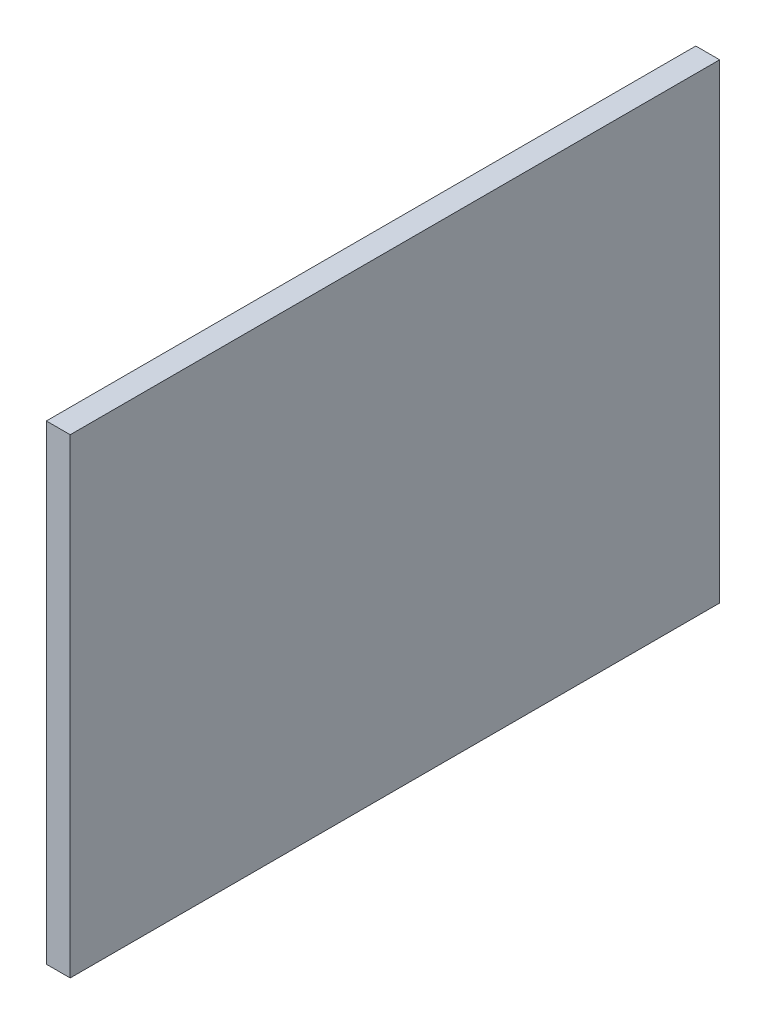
ISO-10303-21;
HEADER;
FILE_DESCRIPTION(('STEP AP214'),'2;1');
FILE_NAME('part.step','',(''),(''),'','','');
FILE_SCHEMA(('AUTOMOTIVE_DESIGN { 1 0 10303 214 1 1 1 1 }'));
ENDSEC;
DATA;
#1=APPLICATION_CONTEXT('core data for automotive mechanical design processes');
#2=APPLICATION_PROTOCOL_DEFINITION('international standard','automotive_design',2000,#1);
#3=PRODUCT_CONTEXT('',#1,'mechanical');
#4=PRODUCT('Part','Part','',(#3));
#5=PRODUCT_RELATED_PRODUCT_CATEGORY('part','',(#4));
#6=PRODUCT_DEFINITION_FORMATION('','',#4);
#7=PRODUCT_DEFINITION_CONTEXT('part definition',#1,'design');
#8=PRODUCT_DEFINITION('design','',#6,#7);
#9=PRODUCT_DEFINITION_SHAPE('','',#8);
#10=(LENGTH_UNIT() NAMED_UNIT(*) SI_UNIT(.MILLI.,.METRE.));
#11=(NAMED_UNIT(*) PLANE_ANGLE_UNIT() SI_UNIT($,.RADIAN.));
#12=(NAMED_UNIT(*) SI_UNIT($,.STERADIAN.) SOLID_ANGLE_UNIT());
#13=UNCERTAINTY_MEASURE_WITH_UNIT(LENGTH_MEASURE(1.E-05),#10,'distance_accuracy_value','');
#14=(GEOMETRIC_REPRESENTATION_CONTEXT(3) GLOBAL_UNCERTAINTY_ASSIGNED_CONTEXT((#13)) GLOBAL_UNIT_ASSIGNED_CONTEXT((#10,
#11,#12)) REPRESENTATION_CONTEXT('',''));
#15=CARTESIAN_POINT('',(0.,0.,0.));
#16=DIRECTION('',(0.,0.,1.));
#17=DIRECTION('',(1.,0.,0.));
#18=AXIS2_PLACEMENT_3D('',#15,#16,#17);
#19=CARTESIAN_POINT('',(263.000000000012,1002.65327241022,-490.));
#20=DIRECTION('',(-1.,0.,0.));
#21=DIRECTION('',(0.,-1.,0.));
#22=AXIS2_PLACEMENT_3D('',#19,#20,#21);
#23=PLANE('',#22);
#24=DIRECTION('',(0.,-1.,0.));
#25=VECTOR('',#24,1.);
#26=CARTESIAN_POINT('',(263.000000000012,1002.65327241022,0.));
#27=LINE('',#26,#25);
#28=CARTESIAN_POINT('',(263.000000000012,1002.65327241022,0.));
#29=VERTEX_POINT('',#28);
#30=CARTESIAN_POINT('',(263.000000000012,647.653272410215,0.));
#31=VERTEX_POINT('',#30);
#32=EDGE_CURVE('E97',#29,#31,#27,.T.);
#33=ORIENTED_EDGE('',*,*,#32,.F.);
#34=DIRECTION('',(0.,0.,1.));
#35=VECTOR('',#34,1.);
#36=CARTESIAN_POINT('',(263.000000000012,1002.65327241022,-490.));
#37=LINE('',#36,#35);
#38=CARTESIAN_POINT('',(263.000000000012,1002.65327241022,-490.));
#39=VERTEX_POINT('',#38);
#40=EDGE_CURVE('E11',#39,#29,#37,.T.);
#41=ORIENTED_EDGE('',*,*,#40,.F.);
#42=DIRECTION('',(0.,-1.,0.));
#43=VECTOR('',#42,1.);
#44=CARTESIAN_POINT('',(263.000000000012,1002.65327241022,-490.));
#45=LINE('',#44,#43);
#46=CARTESIAN_POINT('',(263.000000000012,647.653272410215,-490.));
#47=VERTEX_POINT('',#46);
#48=EDGE_CURVE('E91',#39,#47,#45,.T.);
#49=ORIENTED_EDGE('',*,*,#48,.T.);
#50=DIRECTION('',(0.,0.,1.));
#51=VECTOR('',#50,1.);
#52=CARTESIAN_POINT('',(263.000000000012,647.653272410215,-490.));
#53=LINE('',#52,#51);
#54=EDGE_CURVE('E36',#47,#31,#53,.T.);
#55=ORIENTED_EDGE('',*,*,#54,.T.);
#56=EDGE_LOOP('',(#33,#41,#49,#55));
#57=FACE_BOUND('',#56,.T.);
#58=ADVANCED_FACE('F33',(#57),#23,.T.);
#59=CARTESIAN_POINT('',(263.000000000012,1002.65327241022,-490.));
#60=DIRECTION('',(0.,1.,0.));
#61=DIRECTION('',(-1.,0.,0.));
#62=AXIS2_PLACEMENT_3D('',#59,#60,#61);
#63=PLANE('',#62);
#64=DIRECTION('',(-1.,0.,0.));
#65=VECTOR('',#64,1.);
#66=CARTESIAN_POINT('',(263.000000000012,1002.65327241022,0.));
#67=LINE('',#66,#65);
#68=CARTESIAN_POINT('',(281.000000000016,1002.65327241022,0.));
#69=VERTEX_POINT('',#68);
#70=EDGE_CURVE('E93',#69,#29,#67,.T.);
#71=ORIENTED_EDGE('',*,*,#70,.F.);
#72=DIRECTION('',(0.,0.,1.));
#73=VECTOR('',#72,1.);
#74=CARTESIAN_POINT('',(281.000000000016,1002.65327241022,-490.));
#75=LINE('',#74,#73);
#76=CARTESIAN_POINT('',(281.000000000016,1002.65327241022,-490.));
#77=VERTEX_POINT('',#76);
#78=EDGE_CURVE('E42',#77,#69,#75,.T.);
#79=ORIENTED_EDGE('',*,*,#78,.F.);
#80=DIRECTION('',(-1.,0.,0.));
#81=VECTOR('',#80,1.);
#82=CARTESIAN_POINT('',(263.000000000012,1002.65327241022,-490.));
#83=LINE('',#82,#81);
#84=EDGE_CURVE('E88',#77,#39,#83,.T.);
#85=ORIENTED_EDGE('',*,*,#84,.T.);
#86=ORIENTED_EDGE('',*,*,#40,.T.);
#87=EDGE_LOOP('',(#71,#79,#85,#86));
#88=FACE_BOUND('',#87,.T.);
#89=ADVANCED_FACE('F107',(#88),#63,.T.);
#90=CARTESIAN_POINT('',(281.000000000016,1002.65327241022,-490.));
#91=DIRECTION('',(0.999999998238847,-5.93490124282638E-05,0.));
#92=DIRECTION('',(5.93490124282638E-05,0.999999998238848,0.));
#93=AXIS2_PLACEMENT_3D('',#90,#91,#92);
#94=PLANE('',#93);
#95=DIRECTION('',(5.93490124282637E-05,0.999999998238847,0.));
#96=VECTOR('',#95,1.);
#97=CARTESIAN_POINT('',(281.000000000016,1002.65327241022,0.));
#98=LINE('',#97,#96);
#99=CARTESIAN_POINT('',(280.978931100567,647.653272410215,0.));
#100=VERTEX_POINT('',#99);
#101=EDGE_CURVE('E83',#100,#69,#98,.T.);
#102=ORIENTED_EDGE('',*,*,#101,.F.);
#103=DIRECTION('',(0.,0.,1.));
#104=VECTOR('',#103,1.);
#105=CARTESIAN_POINT('',(280.978931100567,647.653272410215,-490.));
#106=LINE('',#105,#104);
#107=CARTESIAN_POINT('',(280.978931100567,647.653272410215,-490.));
#108=VERTEX_POINT('',#107);
#109=EDGE_CURVE('E78',#108,#100,#106,.T.);
#110=ORIENTED_EDGE('',*,*,#109,.F.);
#111=DIRECTION('',(5.93490124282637E-05,0.999999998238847,0.));
#112=VECTOR('',#111,1.);
#113=CARTESIAN_POINT('',(281.000000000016,1002.65327241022,-490.));
#114=LINE('',#113,#112);
#115=EDGE_CURVE('E81',#108,#77,#114,.T.);
#116=ORIENTED_EDGE('',*,*,#115,.T.);
#117=ORIENTED_EDGE('',*,*,#78,.T.);
#118=EDGE_LOOP('',(#102,#110,#116,#117));
#119=FACE_BOUND('',#118,.T.);
#120=ADVANCED_FACE('F80',(#119),#94,.T.);
#121=CARTESIAN_POINT('',(263.000000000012,647.653272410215,-490.));
#122=DIRECTION('',(0.,-1.,0.));
#123=DIRECTION('',(0.,0.,-1.));
#124=AXIS2_PLACEMENT_3D('',#121,#122,#123);
#125=PLANE('',#124);
#126=DIRECTION('',(1.,0.,0.));
#127=VECTOR('',#126,1.);
#128=CARTESIAN_POINT('',(263.000000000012,647.653272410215,0.));
#129=LINE('',#128,#127);
#130=EDGE_CURVE('E100',#31,#100,#129,.T.);
#131=ORIENTED_EDGE('',*,*,#130,.F.);
#132=ORIENTED_EDGE('',*,*,#54,.F.);
#133=DIRECTION('',(1.,0.,0.));
#134=VECTOR('',#133,1.);
#135=CARTESIAN_POINT('',(263.000000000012,647.653272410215,-490.));
#136=LINE('',#135,#134);
#137=EDGE_CURVE('E87',#47,#108,#136,.T.);
#138=ORIENTED_EDGE('',*,*,#137,.T.);
#139=ORIENTED_EDGE('',*,*,#109,.T.);
#140=EDGE_LOOP('',(#131,#132,#138,#139));
#141=FACE_BOUND('',#140,.T.);
#142=ADVANCED_FACE('F90',(#141),#125,.T.);
#143=CARTESIAN_POINT('',(0.,0.,-490.));
#144=DIRECTION('',(0.,0.,1.));
#145=DIRECTION('',(1.,0.,0.));
#146=AXIS2_PLACEMENT_3D('',#143,#144,#145);
#147=PLANE('',#146);
#148=ORIENTED_EDGE('',*,*,#48,.F.);
#149=ORIENTED_EDGE('',*,*,#84,.F.);
#150=ORIENTED_EDGE('',*,*,#115,.F.);
#151=ORIENTED_EDGE('',*,*,#137,.F.);
#152=EDGE_LOOP('',(#148,#149,#150,#151));
#153=FACE_BOUND('',#152,.T.);
#154=ADVANCED_FACE('F86',(#153),#147,.F.);
#155=CARTESIAN_POINT('',(0.,0.,0.));
#156=DIRECTION('',(0.,0.,1.));
#157=DIRECTION('',(1.,0.,0.));
#158=AXIS2_PLACEMENT_3D('',#155,#156,#157);
#159=PLANE('',#158);
#160=ORIENTED_EDGE('',*,*,#32,.T.);
#161=ORIENTED_EDGE('',*,*,#130,.T.);
#162=ORIENTED_EDGE('',*,*,#101,.T.);
#163=ORIENTED_EDGE('',*,*,#70,.T.);
#164=EDGE_LOOP('',(#160,#161,#162,#163));
#165=FACE_BOUND('',#164,.T.);
#166=ADVANCED_FACE('F106',(#165),#159,.T.);
#167=CLOSED_SHELL('',(#58,#89,#120,#142,#154,#166));
#168=MANIFOLD_SOLID_BREP('B2',#167);
#169=ADVANCED_BREP_SHAPE_REPRESENTATION('',(#18,#168),#14);
#170=SHAPE_DEFINITION_REPRESENTATION(#9,#169);
ENDSEC;
END-ISO-10303-21;
